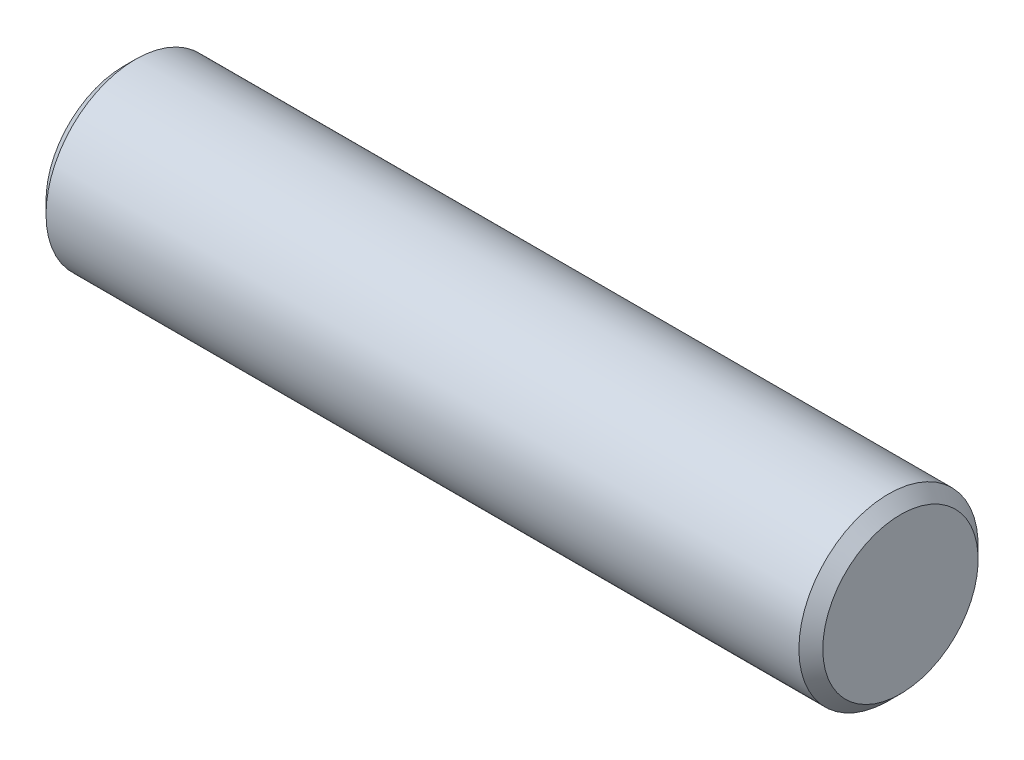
ISO-10303-21;
HEADER;
FILE_DESCRIPTION(('STEP AP214'),'2;1');
FILE_NAME('part.step','',(''),(''),'','','');
FILE_SCHEMA(('AUTOMOTIVE_DESIGN { 1 0 10303 214 1 1 1 1 }'));
ENDSEC;
DATA;
#1=APPLICATION_CONTEXT('core data for automotive mechanical design processes');
#2=APPLICATION_PROTOCOL_DEFINITION('international standard','automotive_design',2000,#1);
#3=PRODUCT_CONTEXT('',#1,'mechanical');
#4=PRODUCT('Part','Part','',(#3));
#5=PRODUCT_RELATED_PRODUCT_CATEGORY('part','',(#4));
#6=PRODUCT_DEFINITION_FORMATION('','',#4);
#7=PRODUCT_DEFINITION_CONTEXT('part definition',#1,'design');
#8=PRODUCT_DEFINITION('design','',#6,#7);
#9=PRODUCT_DEFINITION_SHAPE('','',#8);
#10=(LENGTH_UNIT() NAMED_UNIT(*) SI_UNIT(.MILLI.,.METRE.));
#11=(NAMED_UNIT(*) PLANE_ANGLE_UNIT() SI_UNIT($,.RADIAN.));
#12=(NAMED_UNIT(*) SI_UNIT($,.STERADIAN.) SOLID_ANGLE_UNIT());
#13=UNCERTAINTY_MEASURE_WITH_UNIT(LENGTH_MEASURE(1.E-05),#10,'distance_accuracy_value','');
#14=(GEOMETRIC_REPRESENTATION_CONTEXT(3) GLOBAL_UNCERTAINTY_ASSIGNED_CONTEXT((#13)) GLOBAL_UNIT_ASSIGNED_CONTEXT((#10,
#11,#12)) REPRESENTATION_CONTEXT('',''));
#15=CARTESIAN_POINT('',(0.,0.,0.));
#16=DIRECTION('',(0.,0.,1.));
#17=DIRECTION('',(1.,0.,0.));
#18=AXIS2_PLACEMENT_3D('',#15,#16,#17);
#19=CARTESIAN_POINT('',(6.5,0.,0.));
#20=DIRECTION('',(1.,0.,0.));
#21=DIRECTION('',(0.,0.,-1.));
#22=AXIS2_PLACEMENT_3D('',#19,#20,#21);
#23=PLANE('',#22);
#24=CARTESIAN_POINT('',(6.50000000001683,0.,0.));
#25=DIRECTION('',(-1.,0.,0.));
#26=DIRECTION('',(0.,0.,1.));
#27=AXIS2_PLACEMENT_3D('',#24,#25,#26);
#28=CIRCLE('',#27,0.650000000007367);
#29=CARTESIAN_POINT('',(6.50000000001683,0.,0.650000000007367));
#30=VERTEX_POINT('',#29);
#31=EDGE_CURVE('E18',#30,#30,#28,.T.);
#32=ORIENTED_EDGE('',*,*,#31,.F.);
#33=EDGE_LOOP('',(#32));
#34=FACE_BOUND('',#33,.T.);
#35=ADVANCED_FACE('F15',(#34),#23,.T.);
#36=CARTESIAN_POINT('',(0.,0.,0.));
#37=DIRECTION('',(1.,0.,0.));
#38=DIRECTION('',(0.,0.,-1.));
#39=AXIS2_PLACEMENT_3D('',#36,#37,#38);
#40=PLANE('',#39);
#41=CARTESIAN_POINT('',(0.,0.,0.));
#42=DIRECTION('',(1.,0.,0.));
#43=DIRECTION('',(0.,1.,0.));
#44=AXIS2_PLACEMENT_3D('',#41,#42,#43);
#45=CIRCLE('',#44,0.649999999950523);
#46=CARTESIAN_POINT('',(0.,0.649999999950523,0.));
#47=VERTEX_POINT('',#46);
#48=EDGE_CURVE('E27',#47,#47,#45,.T.);
#49=ORIENTED_EDGE('',*,*,#48,.F.);
#50=EDGE_LOOP('',(#49));
#51=FACE_BOUND('',#50,.T.);
#52=ADVANCED_FACE('F38',(#51),#40,.F.);
#53=CARTESIAN_POINT('',(6.39999999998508,0.,0.));
#54=DIRECTION('',(-1.,0.,0.));
#55=DIRECTION('',(0.,0.,1.));
#56=AXIS2_PLACEMENT_3D('',#53,#54,#55);
#57=CONICAL_SURFACE('',#56,0.750000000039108,0.785398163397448);
#58=CARTESIAN_POINT('',(6.4,0.,0.));
#59=DIRECTION('',(-1.,0.,0.));
#60=DIRECTION('',(0.,0.,1.));
#61=AXIS2_PLACEMENT_3D('',#58,#59,#60);
#62=CIRCLE('',#61,0.75);
#63=CARTESIAN_POINT('',(6.4,0.,0.75));
#64=VERTEX_POINT('',#63);
#65=EDGE_CURVE('E22',#64,#64,#62,.T.);
#66=ORIENTED_EDGE('',*,*,#65,.F.);
#67=EDGE_LOOP('',(#66));
#68=FACE_BOUND('',#67,.T.);
#69=ORIENTED_EDGE('',*,*,#31,.T.);
#70=EDGE_LOOP('',(#69));
#71=FACE_BOUND('',#70,.T.);
#72=ADVANCED_FACE('F35',(#68,#71),#57,.T.);
#73=CARTESIAN_POINT('',(0.0999999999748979,0.,0.));
#74=DIRECTION('',(1.,0.,0.));
#75=DIRECTION('',(0.,1.,0.));
#76=AXIS2_PLACEMENT_3D('',#73,#74,#75);
#77=CONICAL_SURFACE('',#76,0.749999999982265,0.785398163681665);
#78=CARTESIAN_POINT('',(0.100000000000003,0.,0.));
#79=DIRECTION('',(-1.,0.,0.));
#80=DIRECTION('',(0.,0.,1.));
#81=AXIS2_PLACEMENT_3D('',#78,#79,#80);
#82=CIRCLE('',#81,0.75);
#83=CARTESIAN_POINT('',(0.100000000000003,0.,0.75));
#84=VERTEX_POINT('',#83);
#85=EDGE_CURVE('E10',#84,#84,#82,.F.);
#86=ORIENTED_EDGE('',*,*,#85,.F.);
#87=EDGE_LOOP('',(#86));
#88=FACE_BOUND('',#87,.T.);
#89=ORIENTED_EDGE('',*,*,#48,.T.);
#90=EDGE_LOOP('',(#89));
#91=FACE_BOUND('',#90,.T.);
#92=ADVANCED_FACE('F46',(#88,#91),#77,.T.);
#93=CARTESIAN_POINT('',(6.5,0.,0.));
#94=DIRECTION('',(-1.,0.,0.));
#95=DIRECTION('',(0.,0.,1.));
#96=AXIS2_PLACEMENT_3D('',#93,#94,#95);
#97=CYLINDRICAL_SURFACE('',#96,0.75);
#98=ORIENTED_EDGE('',*,*,#85,.T.);
#99=EDGE_LOOP('',(#98));
#100=FACE_BOUND('',#99,.T.);
#101=ORIENTED_EDGE('',*,*,#65,.T.);
#102=EDGE_LOOP('',(#101));
#103=FACE_BOUND('',#102,.T.);
#104=ADVANCED_FACE('F44',(#100,#103),#97,.T.);
#105=CLOSED_SHELL('',(#35,#52,#72,#92,#104));
#106=MANIFOLD_SOLID_BREP('B1',#105);
#107=ADVANCED_BREP_SHAPE_REPRESENTATION('',(#18,#106),#14);
#108=SHAPE_DEFINITION_REPRESENTATION(#9,#107);
ENDSEC;
END-ISO-10303-21;
